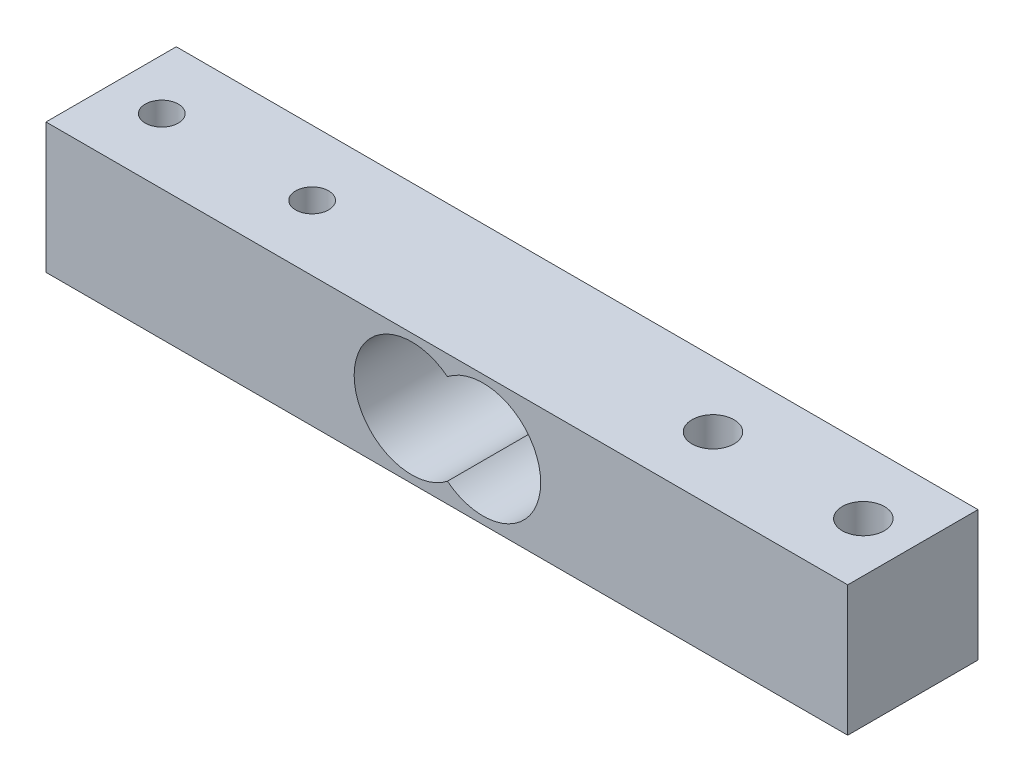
ISO-10303-21;
HEADER;
FILE_DESCRIPTION(('STEP AP214'),'2;1');
FILE_NAME('part.step','',(''),(''),'','','');
FILE_SCHEMA(('AUTOMOTIVE_DESIGN { 1 0 10303 214 1 1 1 1 }'));
ENDSEC;
DATA;
#1=APPLICATION_CONTEXT('core data for automotive mechanical design processes');
#2=APPLICATION_PROTOCOL_DEFINITION('international standard','automotive_design',2000,#1);
#3=PRODUCT_CONTEXT('',#1,'mechanical');
#4=PRODUCT('Part','Part','',(#3));
#5=PRODUCT_RELATED_PRODUCT_CATEGORY('part','',(#4));
#6=PRODUCT_DEFINITION_FORMATION('','',#4);
#7=PRODUCT_DEFINITION_CONTEXT('part definition',#1,'design');
#8=PRODUCT_DEFINITION('design','',#6,#7);
#9=PRODUCT_DEFINITION_SHAPE('','',#8);
#10=(LENGTH_UNIT() NAMED_UNIT(*) SI_UNIT(.MILLI.,.METRE.));
#11=(NAMED_UNIT(*) PLANE_ANGLE_UNIT() SI_UNIT($,.RADIAN.));
#12=(NAMED_UNIT(*) SI_UNIT($,.STERADIAN.) SOLID_ANGLE_UNIT());
#13=UNCERTAINTY_MEASURE_WITH_UNIT(LENGTH_MEASURE(1.E-05),#10,'distance_accuracy_value','');
#14=(GEOMETRIC_REPRESENTATION_CONTEXT(3) GLOBAL_UNCERTAINTY_ASSIGNED_CONTEXT((#13)) GLOBAL_UNIT_ASSIGNED_CONTEXT((#10,
#11,#12)) REPRESENTATION_CONTEXT('',''));
#15=CARTESIAN_POINT('',(0.,0.,0.));
#16=DIRECTION('',(0.,0.,1.));
#17=DIRECTION('',(1.,0.,0.));
#18=AXIS2_PLACEMENT_3D('',#15,#16,#17);
#19=CARTESIAN_POINT('',(0.,0.,13.));
#20=DIRECTION('',(0.,0.,-1.));
#21=DIRECTION('',(-1.,0.,0.));
#22=AXIS2_PLACEMENT_3D('',#19,#20,#21);
#23=PLANE('',#22);
#24=DIRECTION('',(0.,1.,0.));
#25=VECTOR('',#24,1.);
#26=CARTESIAN_POINT('',(40.,-6.5,13.));
#27=LINE('',#26,#25);
#28=CARTESIAN_POINT('',(40.,-6.5,13.));
#29=VERTEX_POINT('',#28);
#30=CARTESIAN_POINT('',(40.,6.5,13.));
#31=VERTEX_POINT('',#30);
#32=EDGE_CURVE('E109',#29,#31,#27,.T.);
#33=ORIENTED_EDGE('',*,*,#32,.T.);
#34=DIRECTION('',(-1.,0.,0.));
#35=VECTOR('',#34,1.);
#36=CARTESIAN_POINT('',(-40.,6.5,13.));
#37=LINE('',#36,#35);
#38=CARTESIAN_POINT('',(-40.,6.5,13.));
#39=VERTEX_POINT('',#38);
#40=EDGE_CURVE('E112',#31,#39,#37,.T.);
#41=ORIENTED_EDGE('',*,*,#40,.T.);
#42=DIRECTION('',(0.,-1.,0.));
#43=VECTOR('',#42,1.);
#44=CARTESIAN_POINT('',(-40.,-6.5,13.));
#45=LINE('',#44,#43);
#46=CARTESIAN_POINT('',(-40.,-6.5,13.));
#47=VERTEX_POINT('',#46);
#48=EDGE_CURVE('E115',#39,#47,#45,.T.);
#49=ORIENTED_EDGE('',*,*,#48,.T.);
#50=DIRECTION('',(1.,0.,0.));
#51=VECTOR('',#50,1.);
#52=CARTESIAN_POINT('',(-40.,-6.5,13.));
#53=LINE('',#52,#51);
#54=EDGE_CURVE('E117',#47,#29,#53,.T.);
#55=ORIENTED_EDGE('',*,*,#54,.T.);
#56=EDGE_LOOP('',(#33,#41,#49,#55));
#57=FACE_BOUND('',#56,.T.);
#58=CARTESIAN_POINT('',(3.612,0.,13.));
#59=DIRECTION('',(0.,0.,1.));
#60=DIRECTION('',(1.,0.,0.));
#61=AXIS2_PLACEMENT_3D('',#58,#59,#60);
#62=CIRCLE('',#61,5.75);
#63=CARTESIAN_POINT('',(0.0560000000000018,-4.51855773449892,13.));
#64=VERTEX_POINT('',#63);
#65=CARTESIAN_POINT('',(0.0560000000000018,4.51855773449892,13.));
#66=VERTEX_POINT('',#65);
#67=EDGE_CURVE('E95',#64,#66,#62,.T.);
#68=ORIENTED_EDGE('',*,*,#67,.F.);
#69=CARTESIAN_POINT('',(-3.5,0.,13.));
#70=DIRECTION('',(0.,0.,1.));
#71=DIRECTION('',(1.,0.,0.));
#72=AXIS2_PLACEMENT_3D('',#69,#70,#71);
#73=CIRCLE('',#72,5.75);
#74=EDGE_CURVE('E89',#66,#64,#73,.T.);
#75=ORIENTED_EDGE('',*,*,#74,.F.);
#76=EDGE_LOOP('',(#68,#75));
#77=FACE_BOUND('',#76,.T.);
#78=ADVANCED_FACE('F37',(#57,#77),#23,.F.);
#79=CARTESIAN_POINT('',(0.,0.,0.));
#80=DIRECTION('',(0.,0.,-1.));
#81=DIRECTION('',(-1.,0.,0.));
#82=AXIS2_PLACEMENT_3D('',#79,#80,#81);
#83=PLANE('',#82);
#84=DIRECTION('',(0.,1.,0.));
#85=VECTOR('',#84,1.);
#86=CARTESIAN_POINT('',(40.,-6.5,0.));
#87=LINE('',#86,#85);
#88=CARTESIAN_POINT('',(40.,-6.5,0.));
#89=VERTEX_POINT('',#88);
#90=CARTESIAN_POINT('',(40.,6.5,0.));
#91=VERTEX_POINT('',#90);
#92=EDGE_CURVE('E108',#89,#91,#87,.T.);
#93=ORIENTED_EDGE('',*,*,#92,.F.);
#94=DIRECTION('',(1.,0.,0.));
#95=VECTOR('',#94,1.);
#96=CARTESIAN_POINT('',(-40.,-6.5,0.));
#97=LINE('',#96,#95);
#98=CARTESIAN_POINT('',(-40.,-6.5,0.));
#99=VERTEX_POINT('',#98);
#100=EDGE_CURVE('E113',#99,#89,#97,.T.);
#101=ORIENTED_EDGE('',*,*,#100,.F.);
#102=DIRECTION('',(0.,-1.,0.));
#103=VECTOR('',#102,1.);
#104=CARTESIAN_POINT('',(-40.,-6.5,0.));
#105=LINE('',#104,#103);
#106=CARTESIAN_POINT('',(-40.,6.5,0.));
#107=VERTEX_POINT('',#106);
#108=EDGE_CURVE('E124',#107,#99,#105,.T.);
#109=ORIENTED_EDGE('',*,*,#108,.F.);
#110=DIRECTION('',(-1.,0.,0.));
#111=VECTOR('',#110,1.);
#112=CARTESIAN_POINT('',(-40.,6.5,0.));
#113=LINE('',#112,#111);
#114=EDGE_CURVE('E122',#91,#107,#113,.T.);
#115=ORIENTED_EDGE('',*,*,#114,.F.);
#116=EDGE_LOOP('',(#93,#101,#109,#115));
#117=FACE_BOUND('',#116,.T.);
#118=CARTESIAN_POINT('',(-3.5,0.,0.));
#119=DIRECTION('',(0.,0.,1.));
#120=DIRECTION('',(1.,0.,0.));
#121=AXIS2_PLACEMENT_3D('',#118,#119,#120);
#122=CIRCLE('',#121,5.75);
#123=CARTESIAN_POINT('',(0.0560000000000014,4.51855773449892,0.));
#124=VERTEX_POINT('',#123);
#125=CARTESIAN_POINT('',(0.0560000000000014,-4.51855773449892,0.));
#126=VERTEX_POINT('',#125);
#127=EDGE_CURVE('E99',#124,#126,#122,.T.);
#128=ORIENTED_EDGE('',*,*,#127,.T.);
#129=CARTESIAN_POINT('',(3.612,0.,0.));
#130=DIRECTION('',(0.,0.,1.));
#131=DIRECTION('',(1.,0.,0.));
#132=AXIS2_PLACEMENT_3D('',#129,#130,#131);
#133=CIRCLE('',#132,5.75);
#134=EDGE_CURVE('E59',#126,#124,#133,.T.);
#135=ORIENTED_EDGE('',*,*,#134,.T.);
#136=EDGE_LOOP('',(#128,#135));
#137=FACE_BOUND('',#136,.T.);
#138=ADVANCED_FACE('F142',(#117,#137),#83,.T.);
#139=CARTESIAN_POINT('',(40.,-6.5,13.));
#140=DIRECTION('',(-1.,0.,0.));
#141=DIRECTION('',(0.,0.,1.));
#142=AXIS2_PLACEMENT_3D('',#139,#140,#141);
#143=PLANE('',#142);
#144=ORIENTED_EDGE('',*,*,#92,.T.);
#145=DIRECTION('',(0.,0.,-1.));
#146=VECTOR('',#145,1.);
#147=CARTESIAN_POINT('',(40.,6.5,13.));
#148=LINE('',#147,#146);
#149=EDGE_CURVE('E11',#31,#91,#148,.T.);
#150=ORIENTED_EDGE('',*,*,#149,.F.);
#151=ORIENTED_EDGE('',*,*,#32,.F.);
#152=DIRECTION('',(0.,0.,-1.));
#153=VECTOR('',#152,1.);
#154=CARTESIAN_POINT('',(40.,-6.5,13.));
#155=LINE('',#154,#153);
#156=EDGE_CURVE('E119',#29,#89,#155,.T.);
#157=ORIENTED_EDGE('',*,*,#156,.T.);
#158=EDGE_LOOP('',(#144,#150,#151,#157));
#159=FACE_BOUND('',#158,.T.);
#160=ADVANCED_FACE('F39',(#159),#143,.F.);
#161=CARTESIAN_POINT('',(-40.,6.5,13.));
#162=DIRECTION('',(0.,-1.,0.));
#163=DIRECTION('',(0.,0.,-1.));
#164=AXIS2_PLACEMENT_3D('',#161,#162,#163);
#165=PLANE('',#164);
#166=CARTESIAN_POINT('',(-34.944,6.5,6.5));
#167=DIRECTION('',(0.,1.,0.));
#168=DIRECTION('',(0.,0.,1.));
#169=AXIS2_PLACEMENT_3D('',#166,#167,#168);
#170=CIRCLE('',#169,1.64999999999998);
#171=CARTESIAN_POINT('',(-34.944,6.5,8.14999999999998));
#172=VERTEX_POINT('',#171);
#173=EDGE_CURVE('E205',#172,#172,#170,.T.);
#174=ORIENTED_EDGE('',*,*,#173,.F.);
#175=EDGE_LOOP('',(#174));
#176=FACE_BOUND('',#175,.T.);
#177=CARTESIAN_POINT('',(-19.944,6.5,6.5));
#178=DIRECTION('',(0.,1.,0.));
#179=DIRECTION('',(0.,0.,1.));
#180=AXIS2_PLACEMENT_3D('',#177,#178,#179);
#181=CIRCLE('',#180,1.64999999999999);
#182=CARTESIAN_POINT('',(-19.944,6.5,8.14999999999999));
#183=VERTEX_POINT('',#182);
#184=EDGE_CURVE('E201',#183,#183,#181,.T.);
#185=ORIENTED_EDGE('',*,*,#184,.F.);
#186=EDGE_LOOP('',(#185));
#187=FACE_BOUND('',#186,.T.);
#188=CARTESIAN_POINT('',(20.056,6.5,6.5));
#189=DIRECTION('',(0.,1.,0.));
#190=DIRECTION('',(0.,0.,1.));
#191=AXIS2_PLACEMENT_3D('',#188,#189,#190);
#192=CIRCLE('',#191,2.09999999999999);
#193=CARTESIAN_POINT('',(20.056,6.5,8.59999999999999));
#194=VERTEX_POINT('',#193);
#195=EDGE_CURVE('E195',#194,#194,#192,.T.);
#196=ORIENTED_EDGE('',*,*,#195,.F.);
#197=EDGE_LOOP('',(#196));
#198=FACE_BOUND('',#197,.T.);
#199=CARTESIAN_POINT('',(35.056,6.5,6.5));
#200=DIRECTION('',(0.,1.,0.));
#201=DIRECTION('',(0.,0.,1.));
#202=AXIS2_PLACEMENT_3D('',#199,#200,#201);
#203=CIRCLE('',#202,2.09999999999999);
#204=CARTESIAN_POINT('',(35.056,6.5,8.59999999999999));
#205=VERTEX_POINT('',#204);
#206=EDGE_CURVE('E191',#205,#205,#203,.T.);
#207=ORIENTED_EDGE('',*,*,#206,.F.);
#208=EDGE_LOOP('',(#207));
#209=FACE_BOUND('',#208,.T.);
#210=ORIENTED_EDGE('',*,*,#114,.T.);
#211=DIRECTION('',(0.,0.,-1.));
#212=VECTOR('',#211,1.);
#213=CARTESIAN_POINT('',(-40.,6.5,13.));
#214=LINE('',#213,#212);
#215=EDGE_CURVE('E45',#39,#107,#214,.T.);
#216=ORIENTED_EDGE('',*,*,#215,.F.);
#217=ORIENTED_EDGE('',*,*,#40,.F.);
#218=ORIENTED_EDGE('',*,*,#149,.T.);
#219=EDGE_LOOP('',(#210,#216,#217,#218));
#220=FACE_BOUND('',#219,.T.);
#221=ADVANCED_FACE('F152',(#176,#187,#198,#209,#220),#165,.F.);
#222=CARTESIAN_POINT('',(-40.,-6.5,13.));
#223=DIRECTION('',(1.,0.,0.));
#224=DIRECTION('',(0.,0.,-1.));
#225=AXIS2_PLACEMENT_3D('',#222,#223,#224);
#226=PLANE('',#225);
#227=ORIENTED_EDGE('',*,*,#108,.T.);
#228=DIRECTION('',(0.,0.,-1.));
#229=VECTOR('',#228,1.);
#230=CARTESIAN_POINT('',(-40.,-6.5,13.));
#231=LINE('',#230,#229);
#232=EDGE_CURVE('E129',#47,#99,#231,.T.);
#233=ORIENTED_EDGE('',*,*,#232,.F.);
#234=ORIENTED_EDGE('',*,*,#48,.F.);
#235=ORIENTED_EDGE('',*,*,#215,.T.);
#236=EDGE_LOOP('',(#227,#233,#234,#235));
#237=FACE_BOUND('',#236,.T.);
#238=ADVANCED_FACE('F136',(#237),#226,.F.);
#239=CARTESIAN_POINT('',(-40.,-6.5,13.));
#240=DIRECTION('',(0.,1.,0.));
#241=DIRECTION('',(0.,0.,1.));
#242=AXIS2_PLACEMENT_3D('',#239,#240,#241);
#243=PLANE('',#242);
#244=CARTESIAN_POINT('',(-34.944,-6.5,6.5));
#245=DIRECTION('',(0.,1.,0.));
#246=DIRECTION('',(0.,0.,1.));
#247=AXIS2_PLACEMENT_3D('',#244,#245,#246);
#248=CIRCLE('',#247,1.65);
#249=CARTESIAN_POINT('',(-34.944,-6.5,8.15));
#250=VERTEX_POINT('',#249);
#251=EDGE_CURVE('E179',#250,#250,#248,.T.);
#252=ORIENTED_EDGE('',*,*,#251,.T.);
#253=EDGE_LOOP('',(#252));
#254=FACE_BOUND('',#253,.T.);
#255=CARTESIAN_POINT('',(-19.944,-6.5,6.5));
#256=DIRECTION('',(0.,1.,0.));
#257=DIRECTION('',(0.,0.,1.));
#258=AXIS2_PLACEMENT_3D('',#255,#256,#257);
#259=CIRCLE('',#258,1.65);
#260=CARTESIAN_POINT('',(-19.944,-6.5,8.15));
#261=VERTEX_POINT('',#260);
#262=EDGE_CURVE('E183',#261,#261,#259,.T.);
#263=ORIENTED_EDGE('',*,*,#262,.T.);
#264=EDGE_LOOP('',(#263));
#265=FACE_BOUND('',#264,.T.);
#266=CARTESIAN_POINT('',(20.056,-6.5,6.5));
#267=DIRECTION('',(0.,1.,0.));
#268=DIRECTION('',(0.,0.,1.));
#269=AXIS2_PLACEMENT_3D('',#266,#267,#268);
#270=CIRCLE('',#269,2.09999999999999);
#271=CARTESIAN_POINT('',(20.056,-6.5,8.59999999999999));
#272=VERTEX_POINT('',#271);
#273=EDGE_CURVE('E187',#272,#272,#270,.T.);
#274=ORIENTED_EDGE('',*,*,#273,.T.);
#275=EDGE_LOOP('',(#274));
#276=FACE_BOUND('',#275,.T.);
#277=CARTESIAN_POINT('',(35.056,-6.5,6.5));
#278=DIRECTION('',(0.,1.,0.));
#279=DIRECTION('',(0.,0.,1.));
#280=AXIS2_PLACEMENT_3D('',#277,#278,#279);
#281=CIRCLE('',#280,2.09999999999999);
#282=CARTESIAN_POINT('',(35.056,-6.5,8.59999999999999));
#283=VERTEX_POINT('',#282);
#284=EDGE_CURVE('E103',#283,#283,#281,.T.);
#285=ORIENTED_EDGE('',*,*,#284,.T.);
#286=EDGE_LOOP('',(#285));
#287=FACE_BOUND('',#286,.T.);
#288=ORIENTED_EDGE('',*,*,#100,.T.);
#289=ORIENTED_EDGE('',*,*,#156,.F.);
#290=ORIENTED_EDGE('',*,*,#54,.F.);
#291=ORIENTED_EDGE('',*,*,#232,.T.);
#292=EDGE_LOOP('',(#288,#289,#290,#291));
#293=FACE_BOUND('',#292,.T.);
#294=ADVANCED_FACE('F146',(#254,#265,#276,#287,#293),#243,.F.);
#295=CARTESIAN_POINT('',(3.612,0.,13.));
#296=DIRECTION('',(0.,0.,-1.));
#297=DIRECTION('',(-1.,0.,0.));
#298=AXIS2_PLACEMENT_3D('',#295,#296,#297);
#299=CYLINDRICAL_SURFACE('',#298,5.75);
#300=ORIENTED_EDGE('',*,*,#134,.F.);
#301=DIRECTION('',(0.,0.,-1.));
#302=VECTOR('',#301,1.);
#303=CARTESIAN_POINT('',(0.0560000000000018,-4.51855773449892,13.));
#304=LINE('',#303,#302);
#305=EDGE_CURVE('E91',#64,#126,#304,.T.);
#306=ORIENTED_EDGE('',*,*,#305,.F.);
#307=ORIENTED_EDGE('',*,*,#67,.T.);
#308=DIRECTION('',(0.,0.,-1.));
#309=VECTOR('',#308,1.);
#310=CARTESIAN_POINT('',(0.0560000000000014,4.51855773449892,13.));
#311=LINE('',#310,#309);
#312=EDGE_CURVE('E52',#66,#124,#311,.T.);
#313=ORIENTED_EDGE('',*,*,#312,.T.);
#314=EDGE_LOOP('',(#300,#306,#307,#313));
#315=FACE_BOUND('',#314,.T.);
#316=ADVANCED_FACE('F97',(#315),#299,.F.);
#317=CARTESIAN_POINT('',(-3.5,0.,13.));
#318=DIRECTION('',(0.,0.,-1.));
#319=DIRECTION('',(-1.,0.,0.));
#320=AXIS2_PLACEMENT_3D('',#317,#318,#319);
#321=CYLINDRICAL_SURFACE('',#320,5.75);
#322=ORIENTED_EDGE('',*,*,#127,.F.);
#323=ORIENTED_EDGE('',*,*,#312,.F.);
#324=ORIENTED_EDGE('',*,*,#74,.T.);
#325=ORIENTED_EDGE('',*,*,#305,.T.);
#326=EDGE_LOOP('',(#322,#323,#324,#325));
#327=FACE_BOUND('',#326,.T.);
#328=ADVANCED_FACE('F90',(#327),#321,.F.);
#329=CARTESIAN_POINT('',(35.056,6.5,6.5));
#330=DIRECTION('',(0.,1.,0.));
#331=DIRECTION('',(0.,0.,1.));
#332=AXIS2_PLACEMENT_3D('',#329,#330,#331);
#333=CYLINDRICAL_SURFACE('',#332,2.09999999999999);
#334=ORIENTED_EDGE('',*,*,#206,.T.);
#335=EDGE_LOOP('',(#334));
#336=FACE_BOUND('',#335,.T.);
#337=ORIENTED_EDGE('',*,*,#284,.F.);
#338=EDGE_LOOP('',(#337));
#339=FACE_BOUND('',#338,.T.);
#340=ADVANCED_FACE('F222',(#336,#339),#333,.F.);
#341=CARTESIAN_POINT('',(20.056,6.5,6.5));
#342=DIRECTION('',(0.,1.,0.));
#343=DIRECTION('',(0.,0.,1.));
#344=AXIS2_PLACEMENT_3D('',#341,#342,#343);
#345=CYLINDRICAL_SURFACE('',#344,2.09999999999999);
#346=ORIENTED_EDGE('',*,*,#195,.T.);
#347=EDGE_LOOP('',(#346));
#348=FACE_BOUND('',#347,.T.);
#349=ORIENTED_EDGE('',*,*,#273,.F.);
#350=EDGE_LOOP('',(#349));
#351=FACE_BOUND('',#350,.T.);
#352=ADVANCED_FACE('F216',(#348,#351),#345,.F.);
#353=CARTESIAN_POINT('',(-19.944,6.5,6.5));
#354=DIRECTION('',(0.,1.,0.));
#355=DIRECTION('',(0.,0.,1.));
#356=AXIS2_PLACEMENT_3D('',#353,#354,#355);
#357=CYLINDRICAL_SURFACE('',#356,1.64999999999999);
#358=ORIENTED_EDGE('',*,*,#262,.F.);
#359=EDGE_LOOP('',(#358));
#360=FACE_BOUND('',#359,.T.);
#361=ORIENTED_EDGE('',*,*,#184,.T.);
#362=EDGE_LOOP('',(#361));
#363=FACE_BOUND('',#362,.T.);
#364=ADVANCED_FACE('F210',(#360,#363),#357,.F.);
#365=CARTESIAN_POINT('',(-34.944,6.5,6.5));
#366=DIRECTION('',(0.,1.,0.));
#367=DIRECTION('',(0.,0.,1.));
#368=AXIS2_PLACEMENT_3D('',#365,#366,#367);
#369=CYLINDRICAL_SURFACE('',#368,1.64999999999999);
#370=ORIENTED_EDGE('',*,*,#251,.F.);
#371=EDGE_LOOP('',(#370));
#372=FACE_BOUND('',#371,.T.);
#373=ORIENTED_EDGE('',*,*,#173,.T.);
#374=EDGE_LOOP('',(#373));
#375=FACE_BOUND('',#374,.T.);
#376=ADVANCED_FACE('F208',(#372,#375),#369,.F.);
#377=CLOSED_SHELL('',(#78,#138,#160,#221,#238,#294,#316,#328,#340,#352,#364,#376));
#378=MANIFOLD_SOLID_BREP('B2',#377);
#379=ADVANCED_BREP_SHAPE_REPRESENTATION('',(#18,#378),#14);
#380=SHAPE_DEFINITION_REPRESENTATION(#9,#379);
ENDSEC;
END-ISO-10303-21;
